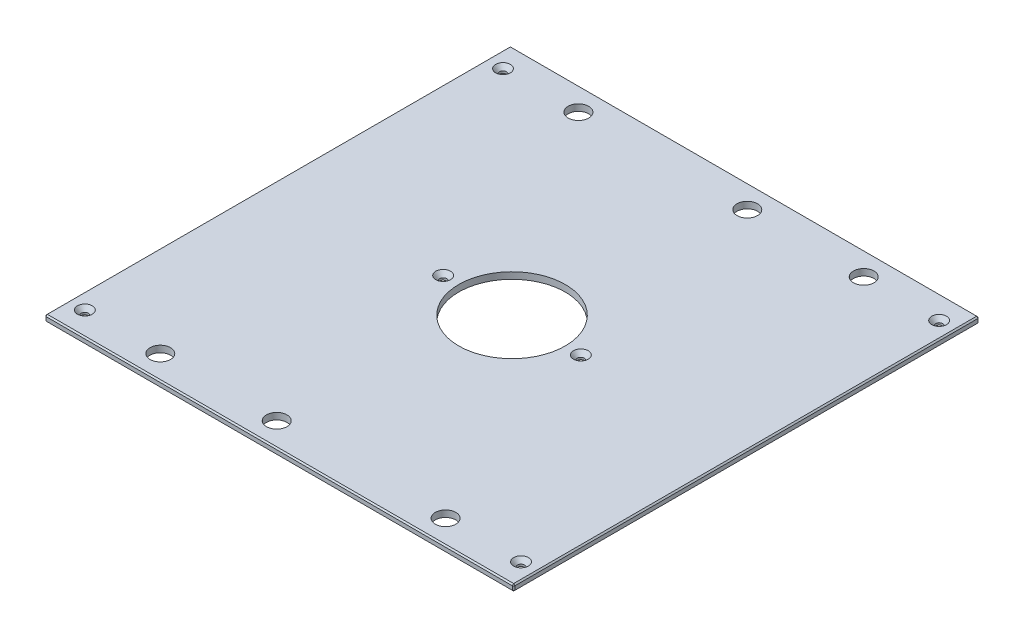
from build123d import *

# Parameters (mm, degrees)
SKETCH1_W                                     = 454.025
SKETCH1_H                                     = 450.85
BOSS_EXTRUDE1_DEPTH                           = 6.35
SKETCH13_R                                    = 51.562
CUT_EXTRUDE6_DEPTH                            = 320.986606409
F_25_32_0_78125_DIAMETER_HOLE1_D              = 19.84375
CHAMFER2_SIZE                                 = 1.27
CSK_FOR_1_4_FLAT_HEAD_MACHINE_SCREW1_AT_COUNT = 2
CSK_FOR_1_4_FLAT_HEAD_MACHINE_SCREW1_AT_PITCH = 404.80996
CSK_FOR_1_4_FLAT_HEAD_MACHINE_SCREW1_2_COUNT  = 2
CSK_FOR_1_4_FLAT_HEAD_MACHINE_SCREW1_2_PITCH  = 584.967759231
CSK_FOR_1_4_FLAT_HEAD_MACHINE_SCREW1_3_COUNT  = 2
CSK_FOR_1_4_FLAT_HEAD_MACHINE_SCREW1_3_PITCH  = 343.725997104
CSK_FOR_1_4_FLAT_HEAD_MACHINE_SCREW1_4_COUNT  = 2
CSK_FOR_1_4_FLAT_HEAD_MACHINE_SCREW1_4_PITCH  = 248.670846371
CSK_FOR_1_4_FLAT_HEAD_MACHINE_SCREW1_5_COUNT  = 2
CSK_FOR_1_4_FLAT_HEAD_MACHINE_SCREW1_5_PITCH  = 422.275
CSK_FOR_1_4_FLAT_HEAD_MACHINE_SCREW1_6_COUNT  = 2
CSK_FOR_1_4_FLAT_HEAD_MACHINE_SCREW1_6_PITCH  = 349.25
CSK_FOR_1_4_FLAT_HEAD_MACHINE_SCREW1_7_COUNT  = 2
CSK_FOR_1_4_FLAT_HEAD_MACHINE_SCREW1_7_PITCH  = 534.646300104


with BuildPart() as part:
    # Sketch1 → Boss-Extrude1 (new body)
    with BuildSketch(Plane(origin=(0, 0, 0), x_dir=(1, 0, 0), z_dir=(0, 1, 0))):
        Rectangle(SKETCH1_W, SKETCH1_H)
    extrude(amount=BOSS_EXTRUDE1_DEPTH)

    # Sketch13 → Cut-Extrude6 (cut, through all)
    with BuildSketch(Plane(origin=(0, 6.35, 0), x_dir=(1, 0, 0), z_dir=(0, 1, 0))):
        with Locations(Location((0, 0, 0), (0, 0, 270))):
            Circle(SKETCH13_R)
    extrude(amount=-CUT_EXTRUDE6_DEPTH, mode=Mode.SUBTRACT)

    # 25_32 _0.78125_ Diameter Hole1 (through all)
    with Locations(Plane(origin=(0, 6.35, 0), x_dir=(1, 0, 0), z_dir=(0, 1, 0))):
        with Locations((138.1125, 202.40498), (-138.1125, 202.40498), (138.1125, -202.40498), (-138.1125, -202.40498), (25.4, 202.40498), (-25.4, -202.40498)):
            Hole(F_25_32_0_78125_DIAMETER_HOLE1_D / 2)

    # Chamfer2
    chamfer2_edges = [part.edges().sort_by_distance(p)[0] for p in [
        (227.0125, 6.35, 0),
        (0, 6.35, -225.425),
        (-227.0125, 6.35, 0),
        (0, 0, -225.425),
        (227.0125, 0, 0),
        (0, 0, 225.425),
        (-227.0125, 0, 0),
        (0, 6.35, 225.425),
        (-227.0125, 3.175, -225.425),
        (227.0125, 3.175, -225.425),
        (227.0125, 3.175, 225.425),
        (-227.0125, 3.175, 225.425),
    ]]
    chamfer(chamfer2_edges, length=CHAMFER2_SIZE)

    # Sketch24 → CSK for 1_4 Flat Head Machine Screw1 (revolve, cut)
    with BuildSketch(Plane(origin=(211.1375, 6.35, -202.40498), x_dir=(0, 0, 1), z_dir=(1, 0, 0))):
        Polygon((0, 0), (0, 6.35), (3.3782, 6.35), (3.3782, 4.324464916), (7.1374, 0), align=None)
    csk_for_1_4_flat_head_machine_screw1 = revolve(axis=Axis((211.1375, 12.7, -202.40498), (0, -1, 0)), mode=Mode.SUBTRACT)

    # CSK for 1_4 Flat Head Machine Screw1 at: CSK for 1_4 Flat Head Machine Screw1 ×2
    with Locations(*[(0, 0, i * CSK_FOR_1_4_FLAT_HEAD_MACHINE_SCREW1_AT_PITCH) for i in range(1, CSK_FOR_1_4_FLAT_HEAD_MACHINE_SCREW1_AT_COUNT)]):
        add(csk_for_1_4_flat_head_machine_screw1, mode=Mode.SUBTRACT)

    # CSK for 1_4 Flat Head Machine Screw1 2: CSK for 1_4 Flat Head Machine Screw1 ×2
    with Locations(*[Vector(-0.7218773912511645, 0, 0.6920209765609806) * (i * CSK_FOR_1_4_FLAT_HEAD_MACHINE_SCREW1_2_PITCH) for i in range(1, CSK_FOR_1_4_FLAT_HEAD_MACHINE_SCREW1_2_COUNT)]):
        add(csk_for_1_4_flat_head_machine_screw1, mode=Mode.SUBTRACT)

    # CSK for 1_4 Flat Head Machine Screw1 3: CSK for 1_4 Flat Head Machine Screw1 ×2
    with Locations(*[Vector(-0.8082382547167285, 0, 0.5888556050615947) * (i * CSK_FOR_1_4_FLAT_HEAD_MACHINE_SCREW1_3_PITCH) for i in range(1, CSK_FOR_1_4_FLAT_HEAD_MACHINE_SCREW1_3_COUNT)]):
        add(csk_for_1_4_flat_head_machine_screw1, mode=Mode.SUBTRACT)

    # CSK for 1_4 Flat Head Machine Screw1 4: CSK for 1_4 Flat Head Machine Screw1 ×2
    with Locations(*[Vector(-0.5809386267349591, 0, 0.813947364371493) * (i * CSK_FOR_1_4_FLAT_HEAD_MACHINE_SCREW1_4_PITCH) for i in range(1, CSK_FOR_1_4_FLAT_HEAD_MACHINE_SCREW1_4_COUNT)]):
        add(csk_for_1_4_flat_head_machine_screw1, mode=Mode.SUBTRACT)

    # CSK for 1_4 Flat Head Machine Screw1 5: CSK for 1_4 Flat Head Machine Screw1 ×2
    with Locations(*[(-i * CSK_FOR_1_4_FLAT_HEAD_MACHINE_SCREW1_5_PITCH, 0, 0) for i in range(1, CSK_FOR_1_4_FLAT_HEAD_MACHINE_SCREW1_5_COUNT)]):
        add(csk_for_1_4_flat_head_machine_screw1, mode=Mode.SUBTRACT)

    # CSK for 1_4 Flat Head Machine Screw1 6: CSK for 1_4 Flat Head Machine Screw1 ×2
    with Locations(*[(-i * CSK_FOR_1_4_FLAT_HEAD_MACHINE_SCREW1_6_PITCH, 0, 0) for i in range(1, CSK_FOR_1_4_FLAT_HEAD_MACHINE_SCREW1_6_COUNT)]):
        add(csk_for_1_4_flat_head_machine_screw1, mode=Mode.SUBTRACT)

    # CSK for 1_4 Flat Head Machine Screw1 7: CSK for 1_4 Flat Head Machine Screw1 ×2
    with Locations(*[Vector(-0.6532356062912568, 0, 0.7571547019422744) * (i * CSK_FOR_1_4_FLAT_HEAD_MACHINE_SCREW1_7_PITCH) for i in range(1, CSK_FOR_1_4_FLAT_HEAD_MACHINE_SCREW1_7_COUNT)]):
        add(csk_for_1_4_flat_head_machine_screw1, mode=Mode.SUBTRACT)


solid = part.part
